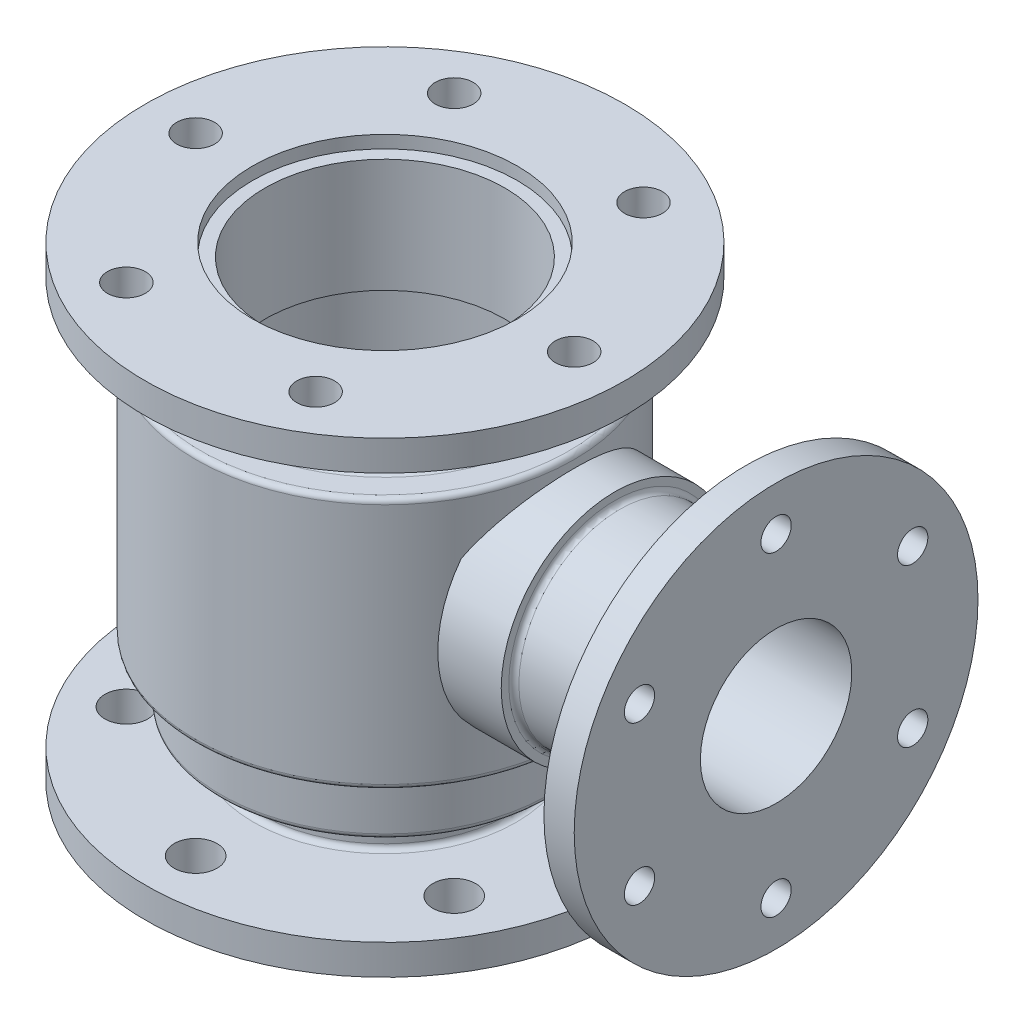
from build123d import *

# Parameters (mm, degrees)
SKETCH3_W          = 122.419685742
SKETCH3_H          = 30
CUT_EXTRUDE1_REACH = 261.374
SKETCH4_R          = 7.5
CUT_EXTRUDE2_REACH = 261.374
SKETCH5_R          = 8.5
CUT_EXTRUDE3_REACH = 327.192
SKETCH6_R          = 6


with BuildPart() as part:
    # Sketch1 → Revolve1 (revolve)
    with BuildSketch(Plane.XY, mode=Mode.PRIVATE) as revolve1_sk:
        with BuildLine():
            Line((36, 0), (95, 0))
            Line((95, 0), (95, 12))
            Line((95, 12), (52, 12))
            ThreePointArc((52, 12), (50.585786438, 12.585786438), (50, 14))
            Line((50, 14), (50, 24))
            ThreePointArc((50, 24), (50.585786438, 25.414213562), (52, 26))
            Line((52, 26), (63, 26))
            ThreePointArc((63, 26), (64.414213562, 26.585786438), (65, 28))
            Line((65, 28), (65, 48))
            ThreePointArc((65, 48), (65.585786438, 49.414213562), (67, 50))
            Line((67, 50), (73, 50))
            ThreePointArc((73, 50), (74.414213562, 50.585786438), (75, 52))
            Line((75, 52), (75, 148))
            ThreePointArc((75, 148), (74.414213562, 149.414213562), (73, 150))
            Line((73, 150), (64.5, 150))
            ThreePointArc((64.5, 150), (63.085786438, 150.585786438), (62.5, 152))
            Line((62.5, 152), (62.5, 171))
            ThreePointArc((62.5, 171), (63.085786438, 172.414213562), (64.5, 173))
            Line((64.5, 173), (95, 173))
            Line((95, 173), (95, 185))
            Line((95, 185), (52.5, 185))
            Line((52.5, 185), (52.5, 180))
            Line((52.5, 180), (47.5, 180))
            Line((47.5, 180), (47.5, 135))
            Line((47.5, 135), (49.5, 135))
            ThreePointArc((49.5, 135), (51.621320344, 134.121320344), (52.5, 132))
            Line((52.5, 132), (52.5, 66))
            ThreePointArc((52.5, 66), (51.621320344, 63.878679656), (49.5, 63))
            Line((49.5, 63), (43.5, 63))
            Line((43.5, 63), (43.5, 48))
            Line((43.5, 48), (41.5, 46))
            Line((41.5, 46), (36, 46))
            Line((36, 46), (36, 0))
        make_face()
    revolve(revolve1_sk.sketch.rotate(Axis((0, 0, 0), (0, 1, 0)), 90), axis=Axis((0, 0, 0), (0, 1, 0)))

    # Sketch2 → Revolve2 (revolve)
    with BuildSketch(Plane.XY, mode=Mode.PRIVATE) as revolve2_sk:
        with BuildLine():
            Line((65.945426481, 55), (91.079922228, 55))
            Line((91.079922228, 55), (91.079922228, 58))
            ThreePointArc((91.079922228, 58), (91.665708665, 59.414213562), (93.079922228, 60))
            Line((93.079922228, 60), (141, 60))
            ThreePointArc((141, 60), (142.414213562, 59.414213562), (143, 58))
            Line((143, 58), (143, 20))
            Line((143, 20), (155, 20))
            Line((155, 20), (155, 100))
            Line((155, 100), (65.945426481, 100))
            Line((65.945426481, 100), (65.945426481, 55))
        make_face()
    revolve(revolve2_sk.sketch.rotate(Axis((-79.633147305, 100, 0), (1, 0, 0)), 270), axis=Axis((-79.633147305, 100, 0), (1, 0, 0)))

    # Sketch3 → Cut-Revolve1 (revolve, cut)
    with BuildSketch(Plane.XY, mode=Mode.PRIVATE) as cut_revolve1_sk:
        with Locations((93.790157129, 85)):
            Rectangle(SKETCH3_W, SKETCH3_H)
    revolve(cut_revolve1_sk.sketch.rotate(Axis((-84.802251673, 100, 0), (1, 0, 0)), 270), axis=Axis((-84.802251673, 100, 0), (1, 0, 0)), mode=Mode.SUBTRACT)

    # Sketch4 → Cut-Extrude1 (cut, up to next)
    with BuildSketch(Plane(origin=(0, 185, 0), x_dir=(-1, 0, 0), z_dir=(0, 1, 0)), mode=Mode.PRIVATE) as cut_extrude1_sk1:
        with Locations(Location((-75, 0, 0), (0, 0, 90))):
            Circle(SKETCH4_R)
    cut_extrude1_tool1 = extrude(cut_extrude1_sk1.sketch, amount=-CUT_EXTRUDE1_REACH, mode=Mode.PRIVATE) & part.part
    # Sketch4 → Cut-Extrude1 (cut, up to next)
    with BuildSketch(Plane(origin=(0, 185, 0), x_dir=(-1, 0, 0), z_dir=(0, 1, 0)), mode=Mode.PRIVATE) as cut_extrude1_sk2:
        with Locations(Location((-37.5, 64.951905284, 0), (0, 0, 90))):
            Circle(SKETCH4_R)
    cut_extrude1_tool2 = extrude(cut_extrude1_sk2.sketch, amount=-CUT_EXTRUDE1_REACH, mode=Mode.PRIVATE) & part.part
    # Sketch4 → Cut-Extrude1 (cut, up to next)
    with BuildSketch(Plane(origin=(0, 185, 0), x_dir=(-1, 0, 0), z_dir=(0, 1, 0)), mode=Mode.PRIVATE) as cut_extrude1_sk3:
        with Locations(Location((37.5, 64.951905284, 0), (0, 0, 90))):
            Circle(SKETCH4_R)
    cut_extrude1_tool3 = extrude(cut_extrude1_sk3.sketch, amount=-CUT_EXTRUDE1_REACH, mode=Mode.PRIVATE) & part.part
    # Sketch4 → Cut-Extrude1 (cut, up to next)
    with BuildSketch(Plane(origin=(0, 185, 0), x_dir=(-1, 0, 0), z_dir=(0, 1, 0)), mode=Mode.PRIVATE) as cut_extrude1_sk4:
        with Locations(Location((75, 0, 0), (0, 0, 90))):
            Circle(SKETCH4_R)
    cut_extrude1_tool4 = extrude(cut_extrude1_sk4.sketch, amount=-CUT_EXTRUDE1_REACH, mode=Mode.PRIVATE) & part.part
    # Sketch4 → Cut-Extrude1 (cut, up to next)
    with BuildSketch(Plane(origin=(0, 185, 0), x_dir=(-1, 0, 0), z_dir=(0, 1, 0)), mode=Mode.PRIVATE) as cut_extrude1_sk5:
        with Locations(Location((37.5, -64.951905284, 0), (0, 0, 90))):
            Circle(SKETCH4_R)
    cut_extrude1_tool5 = extrude(cut_extrude1_sk5.sketch, amount=-CUT_EXTRUDE1_REACH, mode=Mode.PRIVATE) & part.part
    # Sketch4 → Cut-Extrude1 (cut, up to next)
    with BuildSketch(Plane(origin=(0, 185, 0), x_dir=(-1, 0, 0), z_dir=(0, 1, 0)), mode=Mode.PRIVATE) as cut_extrude1_sk6:
        with Locations(Location((-37.5, -64.951905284, 0), (0, 0, 90))):
            Circle(SKETCH4_R)
    cut_extrude1_tool6 = extrude(cut_extrude1_sk6.sketch, amount=-CUT_EXTRUDE1_REACH, mode=Mode.PRIVATE) & part.part
    add(cut_extrude1_tool1.solids().sort_by_distance((75, 185, 0))[0], mode=Mode.SUBTRACT)
    add(cut_extrude1_tool2.solids().sort_by_distance((37.5, 185, 64.951905))[0], mode=Mode.SUBTRACT)
    add(cut_extrude1_tool3.solids().sort_by_distance((-37.5, 185, 64.951905))[0], mode=Mode.SUBTRACT)
    add(cut_extrude1_tool4.solids().sort_by_distance((-75, 185, 0))[0], mode=Mode.SUBTRACT)
    add(cut_extrude1_tool5.solids().sort_by_distance((-37.5, 185, -64.951905))[0], mode=Mode.SUBTRACT)
    add(cut_extrude1_tool6.solids().sort_by_distance((37.5, 185, -64.951905))[0], mode=Mode.SUBTRACT)

    # Sketch5 → Cut-Extrude2 (cut, up to next)
    with BuildSketch(Plane.XZ, mode=Mode.PRIVATE) as cut_extrude2_sk1:
        with Locations(Location((0, 75, 0), (0, 0, 270))):
            Circle(SKETCH5_R)
    cut_extrude2_tool1 = extrude(cut_extrude2_sk1.sketch, amount=-CUT_EXTRUDE2_REACH, mode=Mode.PRIVATE) & part.part
    # Sketch5 → Cut-Extrude2 (cut, up to next)
    with BuildSketch(Plane.XZ, mode=Mode.PRIVATE) as cut_extrude2_sk2:
        with Locations(Location((64.951905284, 37.5, 0), (0, 0, 270))):
            Circle(SKETCH5_R)
    cut_extrude2_tool2 = extrude(cut_extrude2_sk2.sketch, amount=-CUT_EXTRUDE2_REACH, mode=Mode.PRIVATE) & part.part
    # Sketch5 → Cut-Extrude2 (cut, up to next)
    with BuildSketch(Plane.XZ, mode=Mode.PRIVATE) as cut_extrude2_sk3:
        with Locations(Location((64.951905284, -37.5, 0), (0, 0, 270))):
            Circle(SKETCH5_R)
    cut_extrude2_tool3 = extrude(cut_extrude2_sk3.sketch, amount=-CUT_EXTRUDE2_REACH, mode=Mode.PRIVATE) & part.part
    # Sketch5 → Cut-Extrude2 (cut, up to next)
    with BuildSketch(Plane.XZ, mode=Mode.PRIVATE) as cut_extrude2_sk4:
        with Locations(Location((0, -75, 0), (0, 0, 270))):
            Circle(SKETCH5_R)
    cut_extrude2_tool4 = extrude(cut_extrude2_sk4.sketch, amount=-CUT_EXTRUDE2_REACH, mode=Mode.PRIVATE) & part.part
    # Sketch5 → Cut-Extrude2 (cut, up to next)
    with BuildSketch(Plane.XZ, mode=Mode.PRIVATE) as cut_extrude2_sk5:
        with Locations(Location((-64.951905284, -37.5, 0), (0, 0, 270))):
            Circle(SKETCH5_R)
    cut_extrude2_tool5 = extrude(cut_extrude2_sk5.sketch, amount=-CUT_EXTRUDE2_REACH, mode=Mode.PRIVATE) & part.part
    # Sketch5 → Cut-Extrude2 (cut, up to next)
    with BuildSketch(Plane.XZ, mode=Mode.PRIVATE) as cut_extrude2_sk6:
        with Locations(Location((-64.951905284, 37.5, 0), (0, 0, 270))):
            Circle(SKETCH5_R)
    cut_extrude2_tool6 = extrude(cut_extrude2_sk6.sketch, amount=-CUT_EXTRUDE2_REACH, mode=Mode.PRIVATE) & part.part
    add(cut_extrude2_tool1.solids().sort_by_distance((0, 0, 75))[0], mode=Mode.SUBTRACT)
    add(cut_extrude2_tool2.solids().sort_by_distance((64.951905, 0, 37.5))[0], mode=Mode.SUBTRACT)
    add(cut_extrude2_tool3.solids().sort_by_distance((64.951905, 0, -37.5))[0], mode=Mode.SUBTRACT)
    add(cut_extrude2_tool4.solids().sort_by_distance((0, 0, -75))[0], mode=Mode.SUBTRACT)
    add(cut_extrude2_tool5.solids().sort_by_distance((-64.951905, 0, -37.5))[0], mode=Mode.SUBTRACT)
    add(cut_extrude2_tool6.solids().sort_by_distance((-64.951905, 0, 37.5))[0], mode=Mode.SUBTRACT)

    # Sketch6 → Cut-Extrude3 (cut, up to next)
    with BuildSketch(Plane(origin=(155, 0, 0), x_dir=(0, 0, -1), z_dir=(1, 0, 0)), mode=Mode.PRIVATE) as cut_extrude3_sk1:
        with Locations((0, 162.5)):
            Circle(SKETCH6_R)
    cut_extrude3_tool1 = extrude(cut_extrude3_sk1.sketch, amount=-CUT_EXTRUDE3_REACH, mode=Mode.PRIVATE) & part.part
    # Sketch6 → Cut-Extrude3 (cut, up to next)
    with BuildSketch(Plane(origin=(155, 0, 0), x_dir=(0, 0, -1), z_dir=(1, 0, 0)), mode=Mode.PRIVATE) as cut_extrude3_sk2:
        with Locations((54.126587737, 131.25)):
            Circle(SKETCH6_R)
    cut_extrude3_tool2 = extrude(cut_extrude3_sk2.sketch, amount=-CUT_EXTRUDE3_REACH, mode=Mode.PRIVATE) & part.part
    # Sketch6 → Cut-Extrude3 (cut, up to next)
    with BuildSketch(Plane(origin=(155, 0, 0), x_dir=(0, 0, -1), z_dir=(1, 0, 0)), mode=Mode.PRIVATE) as cut_extrude3_sk3:
        with Locations((54.126587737, 68.75)):
            Circle(SKETCH6_R)
    cut_extrude3_tool3 = extrude(cut_extrude3_sk3.sketch, amount=-CUT_EXTRUDE3_REACH, mode=Mode.PRIVATE) & part.part
    # Sketch6 → Cut-Extrude3 (cut, up to next)
    with BuildSketch(Plane(origin=(155, 0, 0), x_dir=(0, 0, -1), z_dir=(1, 0, 0)), mode=Mode.PRIVATE) as cut_extrude3_sk4:
        with Locations((0, 37.5)):
            Circle(SKETCH6_R)
    cut_extrude3_tool4 = extrude(cut_extrude3_sk4.sketch, amount=-CUT_EXTRUDE3_REACH, mode=Mode.PRIVATE) & part.part
    # Sketch6 → Cut-Extrude3 (cut, up to next)
    with BuildSketch(Plane(origin=(155, 0, 0), x_dir=(0, 0, -1), z_dir=(1, 0, 0)), mode=Mode.PRIVATE) as cut_extrude3_sk5:
        with Locations((-54.126587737, 68.75)):
            Circle(SKETCH6_R)
    cut_extrude3_tool5 = extrude(cut_extrude3_sk5.sketch, amount=-CUT_EXTRUDE3_REACH, mode=Mode.PRIVATE) & part.part
    # Sketch6 → Cut-Extrude3 (cut, up to next)
    with BuildSketch(Plane(origin=(155, 0, 0), x_dir=(0, 0, -1), z_dir=(1, 0, 0)), mode=Mode.PRIVATE) as cut_extrude3_sk6:
        with Locations((-54.126587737, 131.25)):
            Circle(SKETCH6_R)
    cut_extrude3_tool6 = extrude(cut_extrude3_sk6.sketch, amount=-CUT_EXTRUDE3_REACH, mode=Mode.PRIVATE) & part.part
    add(cut_extrude3_tool1.solids().sort_by_distance((155, 162.5, 0))[0], mode=Mode.SUBTRACT)
    add(cut_extrude3_tool2.solids().sort_by_distance((155, 131.25, -54.126588))[0], mode=Mode.SUBTRACT)
    add(cut_extrude3_tool3.solids().sort_by_distance((155, 68.75, -54.126588))[0], mode=Mode.SUBTRACT)
    add(cut_extrude3_tool4.solids().sort_by_distance((155, 37.5, 0))[0], mode=Mode.SUBTRACT)
    add(cut_extrude3_tool5.solids().sort_by_distance((155, 68.75, 54.126588))[0], mode=Mode.SUBTRACT)
    add(cut_extrude3_tool6.solids().sort_by_distance((155, 131.25, 54.126588))[0], mode=Mode.SUBTRACT)


solid = part.part
